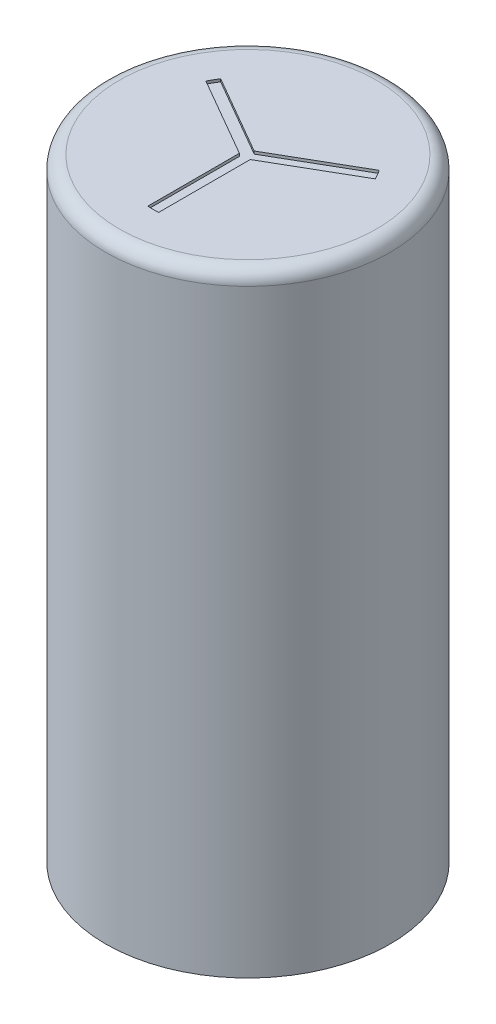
ISO-10303-21;
HEADER;
FILE_DESCRIPTION(('STEP AP214'),'2;1');
FILE_NAME('part.step','',(''),(''),'','','');
FILE_SCHEMA(('AUTOMOTIVE_DESIGN { 1 0 10303 214 1 1 1 1 }'));
ENDSEC;
DATA;
#1=APPLICATION_CONTEXT('core data for automotive mechanical design processes');
#2=APPLICATION_PROTOCOL_DEFINITION('international standard','automotive_design',2000,#1);
#3=PRODUCT_CONTEXT('',#1,'mechanical');
#4=PRODUCT('Part','Part','',(#3));
#5=PRODUCT_RELATED_PRODUCT_CATEGORY('part','',(#4));
#6=PRODUCT_DEFINITION_FORMATION('','',#4);
#7=PRODUCT_DEFINITION_CONTEXT('part definition',#1,'design');
#8=PRODUCT_DEFINITION('design','',#6,#7);
#9=PRODUCT_DEFINITION_SHAPE('','',#8);
#10=(LENGTH_UNIT() NAMED_UNIT(*) SI_UNIT(.MILLI.,.METRE.));
#11=(NAMED_UNIT(*) PLANE_ANGLE_UNIT() SI_UNIT($,.RADIAN.));
#12=(NAMED_UNIT(*) SI_UNIT($,.STERADIAN.) SOLID_ANGLE_UNIT());
#13=UNCERTAINTY_MEASURE_WITH_UNIT(LENGTH_MEASURE(1.E-05),#10,'distance_accuracy_value','');
#14=(GEOMETRIC_REPRESENTATION_CONTEXT(3) GLOBAL_UNCERTAINTY_ASSIGNED_CONTEXT((#13)) GLOBAL_UNIT_ASSIGNED_CONTEXT((#10,
#11,#12)) REPRESENTATION_CONTEXT('',''));
#15=CARTESIAN_POINT('',(0.,0.,0.));
#16=DIRECTION('',(0.,0.,1.));
#17=DIRECTION('',(1.,0.,0.));
#18=AXIS2_PLACEMENT_3D('',#15,#16,#17);
#19=CARTESIAN_POINT('',(0.,11.25,0.));
#20=DIRECTION('',(0.,1.,0.));
#21=DIRECTION('',(0.,0.,1.));
#22=AXIS2_PLACEMENT_3D('',#19,#20,#21);
#23=CYLINDRICAL_SURFACE('',#22,1.75);
#24=CARTESIAN_POINT('',(0.,11.25,0.));
#25=DIRECTION('',(0.,1.,0.));
#26=DIRECTION('',(0.,0.,1.));
#27=AXIS2_PLACEMENT_3D('',#24,#25,#26);
#28=CIRCLE('',#27,1.75);
#29=CARTESIAN_POINT('',(-0.100000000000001,11.25,1.74714052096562));
#30=VERTEX_POINT('',#29);
#31=CARTESIAN_POINT('',(0.0999999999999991,11.25,1.74714052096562));
#32=VERTEX_POINT('',#31);
#33=EDGE_CURVE('E130',#30,#32,#28,.T.);
#34=ORIENTED_EDGE('',*,*,#33,.F.);
#35=DIRECTION('',(0.,1.,0.));
#36=VECTOR('',#35,1.);
#37=CARTESIAN_POINT('',(-0.100000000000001,11.25,1.74714052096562));
#38=LINE('',#37,#36);
#39=CARTESIAN_POINT('',(-0.100000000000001,11.3,1.74714052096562));
#40=VERTEX_POINT('',#39);
#41=EDGE_CURVE('E131',#30,#40,#38,.T.);
#42=ORIENTED_EDGE('',*,*,#41,.T.);
#43=CARTESIAN_POINT('',(0.,11.3,0.));
#44=DIRECTION('',(0.,1.,0.));
#45=DIRECTION('',(0.,0.,1.));
#46=AXIS2_PLACEMENT_3D('',#43,#44,#45);
#47=CIRCLE('',#46,1.75);
#48=CARTESIAN_POINT('',(0.0999999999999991,11.3,1.74714052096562));
#49=VERTEX_POINT('',#48);
#50=EDGE_CURVE('E11',#40,#49,#47,.T.);
#51=ORIENTED_EDGE('',*,*,#50,.T.);
#52=DIRECTION('',(0.,1.,0.));
#53=VECTOR('',#52,1.);
#54=CARTESIAN_POINT('',(0.0999999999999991,11.25,1.74714052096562));
#55=LINE('',#54,#53);
#56=EDGE_CURVE('E36',#32,#49,#55,.T.);
#57=ORIENTED_EDGE('',*,*,#56,.F.);
#58=EDGE_LOOP('',(#34,#42,#51,#57));
#59=FACE_BOUND('',#58,.T.);
#60=ADVANCED_FACE('F17',(#59),#23,.F.);
#61=CARTESIAN_POINT('',(0.,11.05,0.));
#62=DIRECTION('',(0.,1.,0.));
#63=DIRECTION('',(0.,0.,1.));
#64=AXIS2_PLACEMENT_3D('',#61,#62,#63);
#65=TOROIDAL_SURFACE('',#64,2.375,0.25);
#66=CARTESIAN_POINT('',(0.,11.3,0.));
#67=DIRECTION('',(0.,1.,0.));
#68=DIRECTION('',(0.,0.,1.));
#69=AXIS2_PLACEMENT_3D('',#66,#67,#68);
#70=CIRCLE('',#69,2.375);
#71=CARTESIAN_POINT('',(0.,11.3,2.375));
#72=VERTEX_POINT('',#71);
#73=EDGE_CURVE('E155',#72,#72,#70,.T.);
#74=ORIENTED_EDGE('',*,*,#73,.F.);
#75=EDGE_LOOP('',(#74));
#76=FACE_BOUND('',#75,.T.);
#77=CARTESIAN_POINT('',(0.,11.05,0.));
#78=DIRECTION('',(0.,-1.,0.));
#79=DIRECTION('',(0.,0.,1.));
#80=AXIS2_PLACEMENT_3D('',#77,#78,#79);
#81=CIRCLE('',#80,2.625);
#82=CARTESIAN_POINT('',(0.,11.05,2.625));
#83=VERTEX_POINT('',#82);
#84=EDGE_CURVE('E27',#83,#83,#81,.T.);
#85=ORIENTED_EDGE('',*,*,#84,.F.);
#86=EDGE_LOOP('',(#85));
#87=FACE_BOUND('',#86,.T.);
#88=ADVANCED_FACE('F202',(#76,#87),#65,.T.);
#89=CARTESIAN_POINT('',(0.,11.3,0.));
#90=DIRECTION('',(0.,-1.,0.));
#91=DIRECTION('',(0.,0.,-1.));
#92=AXIS2_PLACEMENT_3D('',#89,#90,#91);
#93=CYLINDRICAL_SURFACE('',#92,2.625);
#94=CARTESIAN_POINT('',(0.,0.,0.));
#95=DIRECTION('',(0.,1.,0.));
#96=DIRECTION('',(0.,0.,1.));
#97=AXIS2_PLACEMENT_3D('',#94,#95,#96);
#98=CIRCLE('',#97,2.625);
#99=CARTESIAN_POINT('',(0.,0.,2.625));
#100=VERTEX_POINT('',#99);
#101=EDGE_CURVE('E162',#100,#100,#98,.T.);
#102=ORIENTED_EDGE('',*,*,#101,.T.);
#103=EDGE_LOOP('',(#102));
#104=FACE_BOUND('',#103,.T.);
#105=ORIENTED_EDGE('',*,*,#84,.T.);
#106=EDGE_LOOP('',(#105));
#107=FACE_BOUND('',#106,.T.);
#108=ADVANCED_FACE('F207',(#104,#107),#93,.T.);
#109=CARTESIAN_POINT('',(0.,11.3,0.));
#110=DIRECTION('',(0.,1.,0.));
#111=DIRECTION('',(0.,0.,1.));
#112=AXIS2_PLACEMENT_3D('',#109,#110,#111);
#113=PLANE('',#112);
#114=DIRECTION('',(0.86602540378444,0.,-0.499999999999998));
#115=VECTOR('',#114,1.);
#116=CARTESIAN_POINT('',(0.1,11.3,0.0577350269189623));
#117=LINE('',#116,#115);
#118=CARTESIAN_POINT('',(0.1,11.3,0.0577350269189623));
#119=VERTEX_POINT('',#118);
#120=CARTESIAN_POINT('',(1.5630680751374,11.3,-0.78696772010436));
#121=VERTEX_POINT('',#120);
#122=EDGE_CURVE('E120',#119,#121,#117,.T.);
#123=ORIENTED_EDGE('',*,*,#122,.F.);
#124=DIRECTION('',(0.,0.,-1.));
#125=VECTOR('',#124,1.);
#126=CARTESIAN_POINT('',(0.0999999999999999,11.3,1.74714052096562));
#127=LINE('',#126,#125);
#128=EDGE_CURVE('E127',#49,#119,#127,.T.);
#129=ORIENTED_EDGE('',*,*,#128,.F.);
#130=ORIENTED_EDGE('',*,*,#50,.F.);
#131=DIRECTION('',(0.,0.,1.));
#132=VECTOR('',#131,1.);
#133=CARTESIAN_POINT('',(-0.100000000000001,11.3,1.74714052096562));
#134=LINE('',#133,#132);
#135=CARTESIAN_POINT('',(-0.0999999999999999,11.3,0.0577350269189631));
#136=VERTEX_POINT('',#135);
#137=EDGE_CURVE('E134',#136,#40,#134,.T.);
#138=ORIENTED_EDGE('',*,*,#137,.F.);
#139=DIRECTION('',(0.86602540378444,0.,0.499999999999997));
#140=VECTOR('',#139,1.);
#141=CARTESIAN_POINT('',(-0.0999999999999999,11.3,0.0577350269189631));
#142=LINE('',#141,#140);
#143=CARTESIAN_POINT('',(-1.5630680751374,11.3,-0.78696772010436));
#144=VERTEX_POINT('',#143);
#145=EDGE_CURVE('E142',#144,#136,#142,.T.);
#146=ORIENTED_EDGE('',*,*,#145,.F.);
#147=CARTESIAN_POINT('',(0.,11.3,0.));
#148=DIRECTION('',(0.,1.,0.));
#149=DIRECTION('',(0.,0.,1.));
#150=AXIS2_PLACEMENT_3D('',#147,#148,#149);
#151=CIRCLE('',#150,1.75);
#152=CARTESIAN_POINT('',(-1.4630680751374,11.3,-0.960172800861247));
#153=VERTEX_POINT('',#152);
#154=EDGE_CURVE('E148',#153,#144,#151,.T.);
#155=ORIENTED_EDGE('',*,*,#154,.F.);
#156=DIRECTION('',(-0.86602540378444,0.,-0.499999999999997));
#157=VECTOR('',#156,1.);
#158=CARTESIAN_POINT('',(0.,11.3,-0.115470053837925));
#159=LINE('',#158,#157);
#160=CARTESIAN_POINT('',(0.,11.3,-0.115470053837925));
#161=VERTEX_POINT('',#160);
#162=EDGE_CURVE('E107',#161,#153,#159,.T.);
#163=ORIENTED_EDGE('',*,*,#162,.F.);
#164=DIRECTION('',(-0.86602540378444,0.,0.499999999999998));
#165=VECTOR('',#164,1.);
#166=CARTESIAN_POINT('',(0.,11.3,-0.115470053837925));
#167=LINE('',#166,#165);
#168=CARTESIAN_POINT('',(1.4630680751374,11.3,-0.960172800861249));
#169=VERTEX_POINT('',#168);
#170=EDGE_CURVE('E105',#169,#161,#167,.T.);
#171=ORIENTED_EDGE('',*,*,#170,.F.);
#172=CARTESIAN_POINT('',(0.,11.3,0.));
#173=DIRECTION('',(0.,1.,0.));
#174=DIRECTION('',(0.,0.,1.));
#175=AXIS2_PLACEMENT_3D('',#172,#173,#174);
#176=CIRCLE('',#175,1.75);
#177=EDGE_CURVE('E119',#121,#169,#176,.T.);
#178=ORIENTED_EDGE('',*,*,#177,.F.);
#179=EDGE_LOOP('',(#123,#129,#130,#138,#146,#155,#163,#171,#178));
#180=FACE_BOUND('',#179,.T.);
#181=ORIENTED_EDGE('',*,*,#73,.T.);
#182=EDGE_LOOP('',(#181));
#183=FACE_BOUND('',#182,.T.);
#184=ADVANCED_FACE('F182',(#180,#183),#113,.T.);
#185=CARTESIAN_POINT('',(0.,0.,0.));
#186=DIRECTION('',(0.,1.,0.));
#187=DIRECTION('',(0.,0.,1.));
#188=AXIS2_PLACEMENT_3D('',#185,#186,#187);
#189=PLANE('',#188);
#190=ORIENTED_EDGE('',*,*,#101,.F.);
#191=EDGE_LOOP('',(#190));
#192=FACE_BOUND('',#191,.T.);
#193=ADVANCED_FACE('F216',(#192),#189,.F.);
#194=CARTESIAN_POINT('',(0.,11.25,0.));
#195=DIRECTION('',(0.,1.,0.));
#196=DIRECTION('',(0.,0.,1.));
#197=AXIS2_PLACEMENT_3D('',#194,#195,#196);
#198=CYLINDRICAL_SURFACE('',#197,1.75);
#199=ORIENTED_EDGE('',*,*,#177,.T.);
#200=DIRECTION('',(0.,1.,0.));
#201=VECTOR('',#200,1.);
#202=CARTESIAN_POINT('',(1.4630680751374,11.25,-0.960172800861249));
#203=LINE('',#202,#201);
#204=CARTESIAN_POINT('',(1.4630680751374,11.25,-0.960172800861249));
#205=VERTEX_POINT('',#204);
#206=EDGE_CURVE('E111',#205,#169,#203,.T.);
#207=ORIENTED_EDGE('',*,*,#206,.F.);
#208=CARTESIAN_POINT('',(0.,11.25,0.));
#209=DIRECTION('',(0.,1.,0.));
#210=DIRECTION('',(0.,0.,1.));
#211=AXIS2_PLACEMENT_3D('',#208,#209,#210);
#212=CIRCLE('',#211,1.75);
#213=CARTESIAN_POINT('',(1.5630680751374,11.25,-0.78696772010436));
#214=VERTEX_POINT('',#213);
#215=EDGE_CURVE('E109',#214,#205,#212,.T.);
#216=ORIENTED_EDGE('',*,*,#215,.F.);
#217=DIRECTION('',(0.,1.,0.));
#218=VECTOR('',#217,1.);
#219=CARTESIAN_POINT('',(1.5630680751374,11.25,-0.78696772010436));
#220=LINE('',#219,#218);
#221=EDGE_CURVE('E116',#214,#121,#220,.T.);
#222=ORIENTED_EDGE('',*,*,#221,.T.);
#223=EDGE_LOOP('',(#199,#207,#216,#222));
#224=FACE_BOUND('',#223,.T.);
#225=ADVANCED_FACE('F180',(#224),#198,.F.);
#226=CARTESIAN_POINT('',(0.1,11.25,0.0577350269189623));
#227=DIRECTION('',(0.499999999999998,0.,0.86602540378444));
#228=DIRECTION('',(0.86602540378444,0.,-0.499999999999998));
#229=AXIS2_PLACEMENT_3D('',#226,#227,#228);
#230=PLANE('',#229);
#231=ORIENTED_EDGE('',*,*,#122,.T.);
#232=ORIENTED_EDGE('',*,*,#221,.F.);
#233=DIRECTION('',(0.86602540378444,0.,-0.499999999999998));
#234=VECTOR('',#233,1.);
#235=CARTESIAN_POINT('',(0.1,11.25,0.0577350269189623));
#236=LINE('',#235,#234);
#237=CARTESIAN_POINT('',(0.1,11.25,0.0577350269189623));
#238=VERTEX_POINT('',#237);
#239=EDGE_CURVE('E121',#238,#214,#236,.T.);
#240=ORIENTED_EDGE('',*,*,#239,.F.);
#241=DIRECTION('',(0.,1.,0.));
#242=VECTOR('',#241,1.);
#243=CARTESIAN_POINT('',(0.1,11.25,0.0577350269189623));
#244=LINE('',#243,#242);
#245=EDGE_CURVE('E124',#238,#119,#244,.T.);
#246=ORIENTED_EDGE('',*,*,#245,.T.);
#247=EDGE_LOOP('',(#231,#232,#240,#246));
#248=FACE_BOUND('',#247,.T.);
#249=ADVANCED_FACE('F176',(#248),#230,.F.);
#250=CARTESIAN_POINT('',(0.0999999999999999,11.25,1.74714052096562));
#251=DIRECTION('',(1.,0.,0.));
#252=DIRECTION('',(0.,0.,-1.));
#253=AXIS2_PLACEMENT_3D('',#250,#251,#252);
#254=PLANE('',#253);
#255=ORIENTED_EDGE('',*,*,#128,.T.);
#256=ORIENTED_EDGE('',*,*,#245,.F.);
#257=DIRECTION('',(0.,0.,-1.));
#258=VECTOR('',#257,1.);
#259=CARTESIAN_POINT('',(0.0999999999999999,11.25,1.74714052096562));
#260=LINE('',#259,#258);
#261=EDGE_CURVE('E123',#32,#238,#260,.T.);
#262=ORIENTED_EDGE('',*,*,#261,.F.);
#263=ORIENTED_EDGE('',*,*,#56,.T.);
#264=EDGE_LOOP('',(#255,#256,#262,#263));
#265=FACE_BOUND('',#264,.T.);
#266=ADVANCED_FACE('F173',(#265),#254,.F.);
#267=CARTESIAN_POINT('',(-0.100000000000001,11.25,1.74714052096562));
#268=DIRECTION('',(-1.,0.,0.));
#269=DIRECTION('',(0.,0.,1.));
#270=AXIS2_PLACEMENT_3D('',#267,#268,#269);
#271=PLANE('',#270);
#272=ORIENTED_EDGE('',*,*,#137,.T.);
#273=ORIENTED_EDGE('',*,*,#41,.F.);
#274=DIRECTION('',(0.,0.,1.));
#275=VECTOR('',#274,1.);
#276=CARTESIAN_POINT('',(-0.100000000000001,11.25,1.74714052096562));
#277=LINE('',#276,#275);
#278=CARTESIAN_POINT('',(-0.0999999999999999,11.25,0.0577350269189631));
#279=VERTEX_POINT('',#278);
#280=EDGE_CURVE('E135',#279,#30,#277,.T.);
#281=ORIENTED_EDGE('',*,*,#280,.F.);
#282=DIRECTION('',(0.,1.,0.));
#283=VECTOR('',#282,1.);
#284=CARTESIAN_POINT('',(-0.0999999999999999,11.25,0.0577350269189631));
#285=LINE('',#284,#283);
#286=EDGE_CURVE('E139',#279,#136,#285,.T.);
#287=ORIENTED_EDGE('',*,*,#286,.T.);
#288=EDGE_LOOP('',(#272,#273,#281,#287));
#289=FACE_BOUND('',#288,.T.);
#290=ADVANCED_FACE('F191',(#289),#271,.F.);
#291=CARTESIAN_POINT('',(-0.0999999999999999,11.25,0.0577350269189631));
#292=DIRECTION('',(-0.499999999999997,0.,0.86602540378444));
#293=DIRECTION('',(0.86602540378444,0.,0.499999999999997));
#294=AXIS2_PLACEMENT_3D('',#291,#292,#293);
#295=PLANE('',#294);
#296=ORIENTED_EDGE('',*,*,#145,.T.);
#297=ORIENTED_EDGE('',*,*,#286,.F.);
#298=DIRECTION('',(0.86602540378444,0.,0.499999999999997));
#299=VECTOR('',#298,1.);
#300=CARTESIAN_POINT('',(-0.0999999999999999,11.25,0.0577350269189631));
#301=LINE('',#300,#299);
#302=CARTESIAN_POINT('',(-1.5630680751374,11.25,-0.78696772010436));
#303=VERTEX_POINT('',#302);
#304=EDGE_CURVE('E138',#303,#279,#301,.T.);
#305=ORIENTED_EDGE('',*,*,#304,.F.);
#306=DIRECTION('',(0.,1.,0.));
#307=VECTOR('',#306,1.);
#308=CARTESIAN_POINT('',(-1.5630680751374,11.25,-0.78696772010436));
#309=LINE('',#308,#307);
#310=EDGE_CURVE('E145',#303,#144,#309,.T.);
#311=ORIENTED_EDGE('',*,*,#310,.T.);
#312=EDGE_LOOP('',(#296,#297,#305,#311));
#313=FACE_BOUND('',#312,.T.);
#314=ADVANCED_FACE('F189',(#313),#295,.F.);
#315=CARTESIAN_POINT('',(0.,11.25,0.));
#316=DIRECTION('',(0.,1.,0.));
#317=DIRECTION('',(0.,0.,1.));
#318=AXIS2_PLACEMENT_3D('',#315,#316,#317);
#319=CYLINDRICAL_SURFACE('',#318,1.75);
#320=ORIENTED_EDGE('',*,*,#154,.T.);
#321=ORIENTED_EDGE('',*,*,#310,.F.);
#322=CARTESIAN_POINT('',(0.,11.25,0.));
#323=DIRECTION('',(0.,1.,0.));
#324=DIRECTION('',(0.,0.,1.));
#325=AXIS2_PLACEMENT_3D('',#322,#323,#324);
#326=CIRCLE('',#325,1.75);
#327=CARTESIAN_POINT('',(-1.4630680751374,11.25,-0.960172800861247));
#328=VERTEX_POINT('',#327);
#329=EDGE_CURVE('E87',#328,#303,#326,.T.);
#330=ORIENTED_EDGE('',*,*,#329,.F.);
#331=DIRECTION('',(0.,1.,0.));
#332=VECTOR('',#331,1.);
#333=CARTESIAN_POINT('',(-1.4630680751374,11.25,-0.960172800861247));
#334=LINE('',#333,#332);
#335=EDGE_CURVE('E97',#328,#153,#334,.T.);
#336=ORIENTED_EDGE('',*,*,#335,.T.);
#337=EDGE_LOOP('',(#320,#321,#330,#336));
#338=FACE_BOUND('',#337,.T.);
#339=ADVANCED_FACE('F186',(#338),#319,.F.);
#340=CARTESIAN_POINT('',(0.,11.25,-0.115470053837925));
#341=DIRECTION('',(0.499999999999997,0.,-0.86602540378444));
#342=DIRECTION('',(-0.86602540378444,0.,-0.499999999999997));
#343=AXIS2_PLACEMENT_3D('',#340,#341,#342);
#344=PLANE('',#343);
#345=ORIENTED_EDGE('',*,*,#162,.T.);
#346=ORIENTED_EDGE('',*,*,#335,.F.);
#347=DIRECTION('',(-0.86602540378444,0.,-0.499999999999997));
#348=VECTOR('',#347,1.);
#349=CARTESIAN_POINT('',(0.,11.25,-0.115470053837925));
#350=LINE('',#349,#348);
#351=CARTESIAN_POINT('',(0.,11.25,-0.115470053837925));
#352=VERTEX_POINT('',#351);
#353=EDGE_CURVE('E93',#352,#328,#350,.T.);
#354=ORIENTED_EDGE('',*,*,#353,.F.);
#355=DIRECTION('',(0.,1.,0.));
#356=VECTOR('',#355,1.);
#357=CARTESIAN_POINT('',(0.,11.25,-0.115470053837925));
#358=LINE('',#357,#356);
#359=EDGE_CURVE('E96',#352,#161,#358,.T.);
#360=ORIENTED_EDGE('',*,*,#359,.T.);
#361=EDGE_LOOP('',(#345,#346,#354,#360));
#362=FACE_BOUND('',#361,.T.);
#363=ADVANCED_FACE('F95',(#362),#344,.F.);
#364=CARTESIAN_POINT('',(0.,11.25,-0.115470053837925));
#365=DIRECTION('',(-0.499999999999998,0.,-0.86602540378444));
#366=DIRECTION('',(-0.86602540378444,0.,0.499999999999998));
#367=AXIS2_PLACEMENT_3D('',#364,#365,#366);
#368=PLANE('',#367);
#369=ORIENTED_EDGE('',*,*,#170,.T.);
#370=ORIENTED_EDGE('',*,*,#359,.F.);
#371=DIRECTION('',(-0.86602540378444,0.,0.499999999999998));
#372=VECTOR('',#371,1.);
#373=CARTESIAN_POINT('',(0.,11.25,-0.115470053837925));
#374=LINE('',#373,#372);
#375=EDGE_CURVE('E21',#205,#352,#374,.T.);
#376=ORIENTED_EDGE('',*,*,#375,.F.);
#377=ORIENTED_EDGE('',*,*,#206,.T.);
#378=EDGE_LOOP('',(#369,#370,#376,#377));
#379=FACE_BOUND('',#378,.T.);
#380=ADVANCED_FACE('F103',(#379),#368,.F.);
#381=CARTESIAN_POINT('',(0.,11.25,0.));
#382=DIRECTION('',(0.,1.,0.));
#383=DIRECTION('',(0.,0.,1.));
#384=AXIS2_PLACEMENT_3D('',#381,#382,#383);
#385=PLANE('',#384);
#386=ORIENTED_EDGE('',*,*,#215,.T.);
#387=ORIENTED_EDGE('',*,*,#375,.T.);
#388=ORIENTED_EDGE('',*,*,#353,.T.);
#389=ORIENTED_EDGE('',*,*,#329,.T.);
#390=ORIENTED_EDGE('',*,*,#304,.T.);
#391=ORIENTED_EDGE('',*,*,#280,.T.);
#392=ORIENTED_EDGE('',*,*,#33,.T.);
#393=ORIENTED_EDGE('',*,*,#261,.T.);
#394=ORIENTED_EDGE('',*,*,#239,.T.);
#395=EDGE_LOOP('',(#386,#387,#388,#389,#390,#391,#392,#393,#394));
#396=FACE_BOUND('',#395,.T.);
#397=ADVANCED_FACE('F19',(#396),#385,.T.);
#398=CLOSED_SHELL('',(#60,#88,#108,#184,#193,#225,#249,#266,#290,#314,#339,#363,#380,#397));
#399=MANIFOLD_SOLID_BREP('B1',#398);
#400=ADVANCED_BREP_SHAPE_REPRESENTATION('',(#18,#399),#14);
#401=SHAPE_DEFINITION_REPRESENTATION(#9,#400);
ENDSEC;
END-ISO-10303-21;
